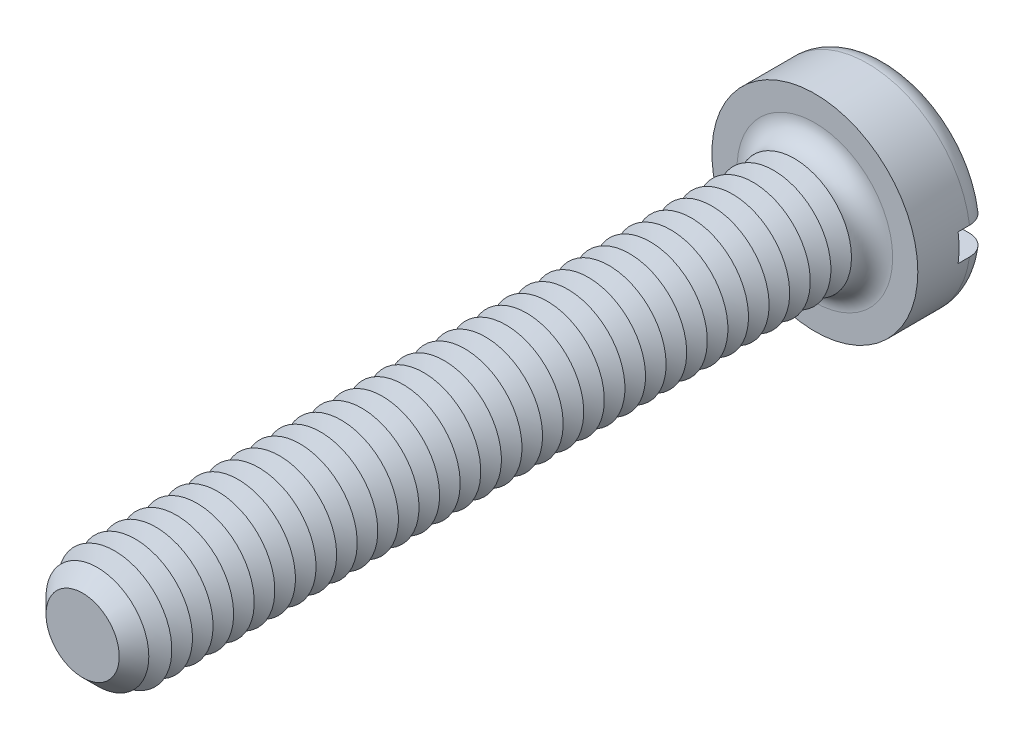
from build123d import *

# Parameters (mm, degrees)
SKETCH3_R           = 2.25
BOSS_EXTRUDE2_DEPTH = 1.6
SKETCH4_R           = 1.25
BOSS_EXTRUDE3_DEPTH = 16
FILLET1_R           = 0.45
CHAMFER1_SIZE       = 0.45
LPATTERN1_COUNT     = 34
LPATTERN1_PITCH     = 0.45
SKETCH8_W           = 4.5
SKETCH8_H           = 0.6
CUT_EXTRUDE1_DEPTH  = 0.7


with BuildPart() as part:
    # Sketch3 → Boss-Extrude2 (new body)
    with BuildSketch(Plane.XY):
        Circle(SKETCH3_R)
    extrude(amount=-BOSS_EXTRUDE2_DEPTH)

    # Sketch4 → Boss-Extrude3 (add)
    with BuildSketch(Plane.XY):
        Circle(SKETCH4_R)
    extrude(amount=BOSS_EXTRUDE3_DEPTH)

    # Fillet1
    fillet1_edges = [part.edges().sort_by_distance(p)[0] for p in [
        (-2.25, 0, -1.6),
        (-1.25, 0, 0),
    ]]
    fillet(fillet1_edges, radius=FILLET1_R)

    # Chamfer1
    chamfer1_edges = [part.edges().sort_by_distance(p)[0] for p in [
        (-1.25, 0, 16),
    ]]
    chamfer(chamfer1_edges, length=CHAMFER1_SIZE)

    # Sketch6 → Cut-Revolve1 (revolve, cut)
    with BuildSketch(Plane(origin=(0, 0, 0), x_dir=(0, 0, -1), z_dir=(1, 0, 0)), mode=Mode.PRIVATE) as cut_revolve1_sk:
        Polygon((-0.45, 1.25), (-0.675, 0.860288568), (-0.9, 1.25), align=None)
    cut_revolve1 = revolve(cut_revolve1_sk.sketch.rotate(Axis((0, 0, -1.694361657), (0, 0, 1)), 90), axis=Axis((0, 0, -1.694361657), (0, 0, 1)), mode=Mode.SUBTRACT)

    # LPattern1: Cut-Revolve1 ×34
    with Locations(*[(0, 0, i * LPATTERN1_PITCH) for i in range(1, LPATTERN1_COUNT)]):
        add(cut_revolve1, mode=Mode.SUBTRACT)

    # Sketch8 → Cut-Extrude1 (cut)
    with BuildSketch(Plane(origin=(0, 0, -1.6), x_dir=(-1, 0, 0), z_dir=(0, 0, -1))):
        Rectangle(SKETCH8_W, SKETCH8_H)
    extrude(amount=-CUT_EXTRUDE1_DEPTH, mode=Mode.SUBTRACT)


solid = part.part
